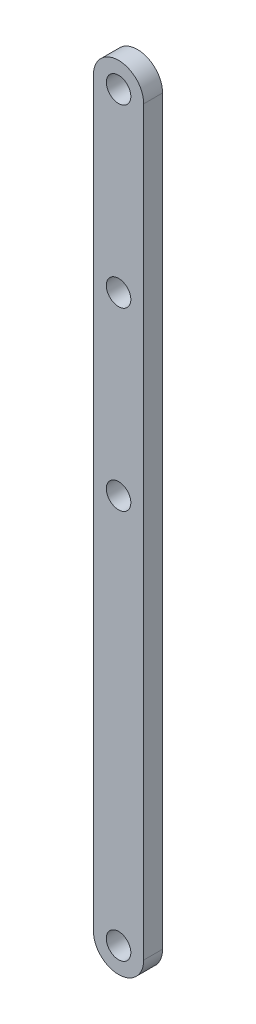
from build123d import *

# Parameters (mm, degrees)
EXTRUDE_1_DEPTH         = 3
HOLE_WIZARD_3_9_3_9_1_D = 3.9


with BuildPart() as part:
    # Sketch 1 → Extrude 1 (new body)
    with BuildSketch(Plane.XY):
        with BuildLine():
            Line((-4, 0), (-4, 118))
            ThreePointArc((-4, 118), (0, 122), (4, 118))
            Line((4, 118), (4, 0))
            ThreePointArc((4, 0), (0, -4), (-4, 0))
        make_face()
    extrude(amount=EXTRUDE_1_DEPTH)

    # Hole Wizard 3.9 _3.9_ _1 (through all)
    with Locations(Plane.XY.offset(3)):
        with Locations((0, 118), (0, 0), (0, 62), (0, 90)):
            Hole(HOLE_WIZARD_3_9_3_9_1_D / 2)


solid = part.part
